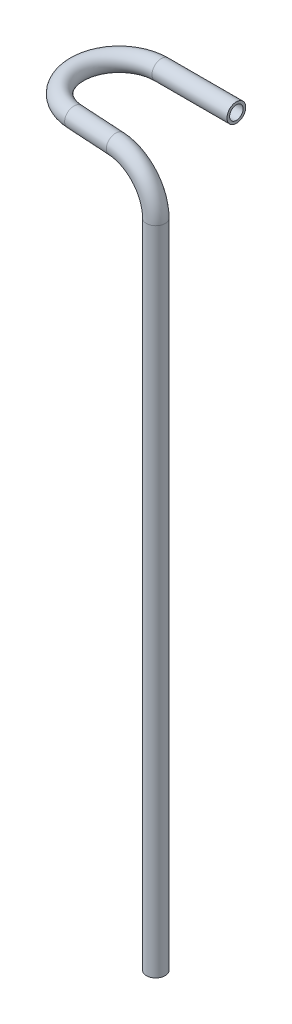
from build123d import *

# Parameters (mm, degrees)
SKETCH1_R   = 3.175
SKETCH1_R_2 = 2.286


with BuildPart() as part:
    # Sweep1: sweep along a curve in space
    with BuildLine() as sweep1_path:
        Line((0, 0, 0), (-25.4, 0, 0))
        ThreePointArc((-25.4, 0, 0), (-39.681117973, 0, 13.860503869), (-26.253610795, 0, 28.549477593))
        Line((-26.253610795, 0, 28.549477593), (-11.239377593, 0, 29.448112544))
        ThreePointArc((-11.239377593, 0, 29.448112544), (-1.154636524, -4.184711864, 30.051706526), (3.0226, -14.2875, 30.301723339))
        Line((3.0226, -14.2875, 30.301723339), (3.0226, -234.95, 30.301723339))
    # Sketch1 → Sweep1 (sweep)
    with BuildSketch(Plane(origin=(0, 0, 0), x_dir=(0, 0, -1), z_dir=(1, 0, 0))):
        Circle(SKETCH1_R)
        Circle(SKETCH1_R_2, mode=Mode.SUBTRACT)
    sweep(path=sweep1_path.line)


solid = part.part
